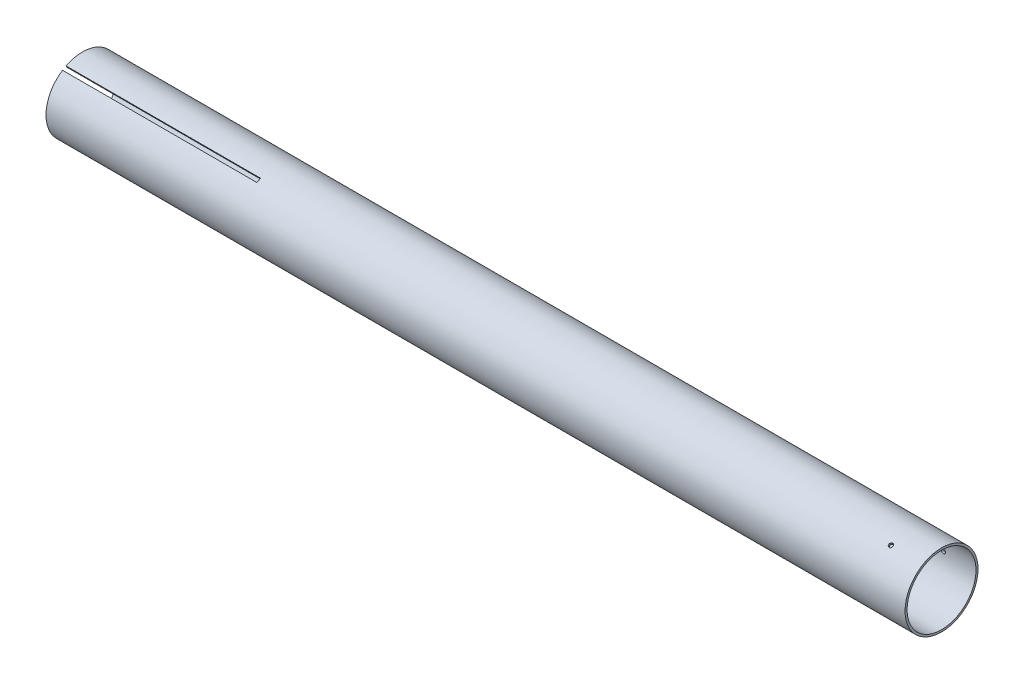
ISO-10303-21;
HEADER;
FILE_DESCRIPTION(('STEP AP214'),'2;1');
FILE_NAME('part.step','',(''),(''),'','','');
FILE_SCHEMA(('AUTOMOTIVE_DESIGN { 1 0 10303 214 1 1 1 1 }'));
ENDSEC;
DATA;
#1=APPLICATION_CONTEXT('core data for automotive mechanical design processes');
#2=APPLICATION_PROTOCOL_DEFINITION('international standard','automotive_design',2000,#1);
#3=PRODUCT_CONTEXT('',#1,'mechanical');
#4=PRODUCT('Part','Part','',(#3));
#5=PRODUCT_RELATED_PRODUCT_CATEGORY('part','',(#4));
#6=PRODUCT_DEFINITION_FORMATION('','',#4);
#7=PRODUCT_DEFINITION_CONTEXT('part definition',#1,'design');
#8=PRODUCT_DEFINITION('design','',#6,#7);
#9=PRODUCT_DEFINITION_SHAPE('','',#8);
#10=(LENGTH_UNIT() NAMED_UNIT(*) SI_UNIT(.MILLI.,.METRE.));
#11=(NAMED_UNIT(*) PLANE_ANGLE_UNIT() SI_UNIT($,.RADIAN.));
#12=(NAMED_UNIT(*) SI_UNIT($,.STERADIAN.) SOLID_ANGLE_UNIT());
#13=UNCERTAINTY_MEASURE_WITH_UNIT(LENGTH_MEASURE(1.E-05),#10,'distance_accuracy_value','');
#14=(GEOMETRIC_REPRESENTATION_CONTEXT(3) GLOBAL_UNCERTAINTY_ASSIGNED_CONTEXT((#13)) GLOBAL_UNIT_ASSIGNED_CONTEXT((#10,
#11,#12)) REPRESENTATION_CONTEXT('',''));
#15=CARTESIAN_POINT('',(0.,0.,0.));
#16=DIRECTION('',(0.,0.,1.));
#17=DIRECTION('',(1.,0.,0.));
#18=AXIS2_PLACEMENT_3D('',#15,#16,#17);
#19=CARTESIAN_POINT('',(0.,0.,0.));
#20=DIRECTION('',(1.,0.,0.));
#21=DIRECTION('',(0.,0.,-1.));
#22=AXIS2_PLACEMENT_3D('',#19,#20,#21);
#23=PLANE('',#22);
#24=CARTESIAN_POINT('',(0.,0.,0.));
#25=DIRECTION('',(1.,0.,0.));
#26=DIRECTION('',(0.,0.,-1.));
#27=AXIS2_PLACEMENT_3D('',#24,#25,#26);
#28=CIRCLE('',#27,28.575);
#29=CARTESIAN_POINT('',(0.,-25.5022070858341,12.8906190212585));
#30=VERTEX_POINT('',#29);
#31=CARTESIAN_POINT('',(0.,-1.5875,-28.5308686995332));
#32=VERTEX_POINT('',#31);
#33=EDGE_CURVE('E142',#30,#32,#28,.T.);
#34=ORIENTED_EDGE('',*,*,#33,.F.);
#35=DIRECTION('',(0.,0.866025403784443,-0.499999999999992));
#36=VECTOR('',#35,1.);
#37=CARTESIAN_POINT('',(0.,-34.5983379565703,18.142272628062));
#38=LINE('',#37,#36);
#39=CARTESIAN_POINT('',(0.,-24.1251398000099,12.0955688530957));
#40=VERTEX_POINT('',#39);
#41=EDGE_CURVE('E127',#30,#40,#38,.T.);
#42=ORIENTED_EDGE('',*,*,#41,.T.);
#43=CARTESIAN_POINT('',(0.,0.,0.));
#44=DIRECTION('',(1.,0.,0.));
#45=DIRECTION('',(0.,0.,-1.));
#46=AXIS2_PLACEMENT_3D('',#43,#44,#45);
#47=CIRCLE('',#46,26.9875);
#48=CARTESIAN_POINT('',(0.,-1.58749999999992,-26.9407683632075));
#49=VERTEX_POINT('',#48);
#50=EDGE_CURVE('E183',#40,#49,#47,.T.);
#51=ORIENTED_EDGE('',*,*,#50,.T.);
#52=DIRECTION('',(0.,0.,1.));
#53=VECTOR('',#52,1.);
#54=CARTESIAN_POINT('',(0.,-1.5875,-28.575));
#55=LINE('',#54,#53);
#56=EDGE_CURVE('E199',#32,#49,#55,.T.);
#57=ORIENTED_EDGE('',*,*,#56,.F.);
#58=EDGE_LOOP('',(#34,#42,#51,#57));
#59=FACE_BOUND('',#58,.T.);
#60=ADVANCED_FACE('F31',(#59),#23,.F.);
#61=CARTESIAN_POINT('',(0.,22.5376398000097,14.8451995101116));
#62=VERTEX_POINT('',#61);
#63=CARTESIAN_POINT('',(0.,-22.5376398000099,14.8451995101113));
#64=VERTEX_POINT('',#63);
#65=EDGE_CURVE('E136',#62,#64,#47,.T.);
#66=ORIENTED_EDGE('',*,*,#65,.T.);
#67=DIRECTION('',(0.,0.866025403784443,-0.499999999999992));
#68=VECTOR('',#67,1.);
#69=CARTESIAN_POINT('',(0.,-33.0108379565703,20.8919032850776));
#70=LINE('',#69,#68);
#71=CARTESIAN_POINT('',(0.,-23.9147070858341,15.6402496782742));
#72=VERTEX_POINT('',#71);
#73=EDGE_CURVE('E47',#72,#64,#70,.T.);
#74=ORIENTED_EDGE('',*,*,#73,.F.);
#75=CARTESIAN_POINT('',(0.,23.9147070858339,15.6402496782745));
#76=VERTEX_POINT('',#75);
#77=EDGE_CURVE('E134',#76,#72,#28,.T.);
#78=ORIENTED_EDGE('',*,*,#77,.F.);
#79=DIRECTION('',(0.,-0.866025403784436,-0.500000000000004));
#80=VECTOR('',#79,1.);
#81=CARTESIAN_POINT('',(0.,33.0108379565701,20.8919032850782));
#82=LINE('',#81,#80);
#83=EDGE_CURVE('E247',#76,#62,#82,.T.);
#84=ORIENTED_EDGE('',*,*,#83,.T.);
#85=EDGE_LOOP('',(#66,#74,#78,#84));
#86=FACE_BOUND('',#85,.T.);
#87=ADVANCED_FACE('F132',(#86),#23,.F.);
#88=CARTESIAN_POINT('',(673.1,0.,0.));
#89=DIRECTION('',(1.,0.,0.));
#90=DIRECTION('',(0.,0.,-1.));
#91=AXIS2_PLACEMENT_3D('',#88,#89,#90);
#92=PLANE('',#91);
#93=CARTESIAN_POINT('',(673.1,0.,0.));
#94=DIRECTION('',(1.,0.,0.));
#95=DIRECTION('',(0.,0.,-1.));
#96=AXIS2_PLACEMENT_3D('',#93,#94,#95);
#97=CIRCLE('',#96,28.575);
#98=CARTESIAN_POINT('',(673.1,0.,-28.575));
#99=VERTEX_POINT('',#98);
#100=EDGE_CURVE('E145',#99,#99,#97,.T.);
#101=ORIENTED_EDGE('',*,*,#100,.T.);
#102=EDGE_LOOP('',(#101));
#103=FACE_BOUND('',#102,.T.);
#104=CARTESIAN_POINT('',(673.1,0.,0.));
#105=DIRECTION('',(1.,0.,0.));
#106=DIRECTION('',(0.,0.,-1.));
#107=AXIS2_PLACEMENT_3D('',#104,#105,#106);
#108=CIRCLE('',#107,26.9875);
#109=CARTESIAN_POINT('',(673.1,0.,-26.9875));
#110=VERTEX_POINT('',#109);
#111=EDGE_CURVE('E146',#110,#110,#108,.T.);
#112=ORIENTED_EDGE('',*,*,#111,.F.);
#113=EDGE_LOOP('',(#112));
#114=FACE_BOUND('',#113,.T.);
#115=ADVANCED_FACE('F316',(#103,#114),#92,.T.);
#116=CARTESIAN_POINT('',(0.,1.58750000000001,-26.9407683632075));
#117=VERTEX_POINT('',#116);
#118=CARTESIAN_POINT('',(0.,24.1251398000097,12.0955688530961));
#119=VERTEX_POINT('',#118);
#120=EDGE_CURVE('E187',#117,#119,#47,.T.);
#121=ORIENTED_EDGE('',*,*,#120,.T.);
#122=DIRECTION('',(0.,-0.866025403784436,-0.500000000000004));
#123=VECTOR('',#122,1.);
#124=CARTESIAN_POINT('',(0.,34.5983379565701,18.1422726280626));
#125=LINE('',#124,#123);
#126=CARTESIAN_POINT('',(0.,25.5022070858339,12.8906190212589));
#127=VERTEX_POINT('',#126);
#128=EDGE_CURVE('E55',#127,#119,#125,.T.);
#129=ORIENTED_EDGE('',*,*,#128,.F.);
#130=CARTESIAN_POINT('',(0.,1.58750000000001,-28.5308686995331));
#131=VERTEX_POINT('',#130);
#132=EDGE_CURVE('E141',#131,#127,#28,.T.);
#133=ORIENTED_EDGE('',*,*,#132,.F.);
#134=DIRECTION('',(0.,0.,1.));
#135=VECTOR('',#134,1.);
#136=CARTESIAN_POINT('',(0.,1.58750000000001,-28.575));
#137=LINE('',#136,#135);
#138=EDGE_CURVE('E262',#131,#117,#137,.T.);
#139=ORIENTED_EDGE('',*,*,#138,.T.);
#140=EDGE_LOOP('',(#121,#129,#133,#139));
#141=FACE_BOUND('',#140,.T.);
#142=ADVANCED_FACE('F312',(#141),#23,.F.);
#143=CARTESIAN_POINT('',(673.1,0.,0.));
#144=DIRECTION('',(-1.,0.,0.));
#145=DIRECTION('',(0.,0.,1.));
#146=AXIS2_PLACEMENT_3D('',#143,#144,#145);
#147=CYLINDRICAL_SURFACE('',#146,28.575);
#148=CARTESIAN_POINT('',(647.7,-23.9147070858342,15.6402496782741));
#149=CARTESIAN_POINT('',(647.789096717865,-23.9147095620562,15.6402465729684));
#150=CARTESIAN_POINT('',(647.878256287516,-23.9188353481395,15.6339429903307));
#151=CARTESIAN_POINT('',(648.054114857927,-23.9352050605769,15.6088692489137));
#152=CARTESIAN_POINT('',(648.140810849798,-23.9474585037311,15.5900844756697));
#153=CARTESIAN_POINT('',(648.309169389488,-23.9796415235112,15.5405368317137));
#154=CARTESIAN_POINT('',(648.390834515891,-23.9995671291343,15.5097801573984));
#155=CARTESIAN_POINT('',(648.546840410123,-24.0463856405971,15.4370924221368));
#156=CARTESIAN_POINT('',(648.621182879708,-24.0732769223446,15.3951639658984));
#157=CARTESIAN_POINT('',(648.760545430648,-24.1331300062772,15.3011685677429));
#158=CARTESIAN_POINT('',(648.825555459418,-24.1660982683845,15.249090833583));
#159=CARTESIAN_POINT('',(648.944321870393,-24.2369716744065,15.1361904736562));
#160=CARTESIAN_POINT('',(648.998077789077,-24.2748770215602,15.0753674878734));
#161=CARTESIAN_POINT('',(649.092839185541,-24.3544009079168,14.9465549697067));
#162=CARTESIAN_POINT('',(649.133836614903,-24.3960217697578,14.8785609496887));
#163=CARTESIAN_POINT('',(649.201865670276,-24.4816262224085,14.7372798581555));
#164=CARTESIAN_POINT('',(649.22889742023,-24.5256097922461,14.6639928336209));
#165=CARTESIAN_POINT('',(649.268200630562,-24.6145370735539,14.5142262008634));
#166=CARTESIAN_POINT('',(649.280487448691,-24.6594797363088,14.4377500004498));
#167=CARTESIAN_POINT('',(649.289999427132,-24.749041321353,14.2836800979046));
#168=CARTESIAN_POINT('',(649.287224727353,-24.7936602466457,14.2060864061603));
#169=CARTESIAN_POINT('',(649.266705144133,-24.8812677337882,14.0520810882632));
#170=CARTESIAN_POINT('',(649.248976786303,-24.9242580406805,13.97566825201));
#171=CARTESIAN_POINT('',(649.199078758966,-25.0075126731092,13.826144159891));
#172=CARTESIAN_POINT('',(649.166909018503,-25.0477769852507,13.7530329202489));
#173=CARTESIAN_POINT('',(649.089022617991,-25.1245848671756,13.6122115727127));
#174=CARTESIAN_POINT('',(649.043298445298,-25.1611263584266,13.5445044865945));
#175=CARTESIAN_POINT('',(648.939606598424,-25.2295923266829,13.416540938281));
#176=CARTESIAN_POINT('',(648.881638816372,-25.261516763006,13.3562845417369));
#177=CARTESIAN_POINT('',(648.75501185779,-25.3200680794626,13.2449517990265));
#178=CARTESIAN_POINT('',(648.686338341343,-25.3466877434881,13.1938879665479));
#179=CARTESIAN_POINT('',(648.540299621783,-25.3940021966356,13.1025924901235));
#180=CARTESIAN_POINT('',(648.462934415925,-25.4146969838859,13.0623608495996));
#181=CARTESIAN_POINT('',(648.301699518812,-25.4497341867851,12.9939654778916));
#182=CARTESIAN_POINT('',(648.217829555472,-25.4640763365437,12.9658022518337));
#183=CARTESIAN_POINT('',(648.045969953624,-25.4861183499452,12.922422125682));
#184=CARTESIAN_POINT('',(647.957980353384,-25.493818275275,12.9072051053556));
#185=CARTESIAN_POINT('',(647.7805050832,-25.5024180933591,12.8902051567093));
#186=CARTESIAN_POINT('',(647.69102156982,-25.503327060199,12.8884043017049));
#187=CARTESIAN_POINT('',(647.512987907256,-25.4983511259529,12.8982457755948));
#188=CARTESIAN_POINT('',(647.424437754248,-25.4924662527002,12.9098880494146));
#189=CARTESIAN_POINT('',(647.25084093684,-25.4740242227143,12.9462398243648));
#190=CARTESIAN_POINT('',(647.165792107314,-25.4614712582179,12.9709411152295));
#191=CARTESIAN_POINT('',(647.00154540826,-25.4299456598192,13.0326391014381));
#192=CARTESIAN_POINT('',(646.922347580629,-25.4109729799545,13.0696358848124));
#193=CARTESIAN_POINT('',(646.771958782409,-25.3669721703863,13.15483334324));
#194=CARTESIAN_POINT('',(646.700776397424,-25.3419376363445,13.2030458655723));
#195=CARTESIAN_POINT('',(646.568525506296,-25.2863553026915,13.3091862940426));
#196=CARTESIAN_POINT('',(646.50745707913,-25.2558074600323,13.3671142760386));
#197=CARTESIAN_POINT('',(646.397100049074,-25.1898421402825,13.4910118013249));
#198=CARTESIAN_POINT('',(646.347824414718,-25.1544193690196,13.5569900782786));
#199=CARTESIAN_POINT('',(646.262540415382,-25.0795639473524,13.6949716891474));
#200=CARTESIAN_POINT('',(646.226531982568,-25.0401313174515,13.766974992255));
#201=CARTESIAN_POINT('',(646.168827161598,-24.9582634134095,13.9148425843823));
#202=CARTESIAN_POINT('',(646.147122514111,-24.9158298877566,13.9907046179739));
#203=CARTESIAN_POINT('',(646.118614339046,-24.8290599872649,14.1441213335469));
#204=CARTESIAN_POINT('',(646.11181070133,-24.7847236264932,14.2216760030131));
#205=CARTESIAN_POINT('',(646.113298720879,-24.695443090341,14.3761491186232));
#206=CARTESIAN_POINT('',(646.121570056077,-24.6504998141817,14.4530682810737));
#207=CARTESIAN_POINT('',(646.152931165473,-24.5612567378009,14.6042116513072));
#208=CARTESIAN_POINT('',(646.176020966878,-24.5169569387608,14.6784358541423));
#209=CARTESIAN_POINT('',(646.23635921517,-24.4303476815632,14.822138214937));
#210=CARTESIAN_POINT('',(646.273607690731,-24.3880382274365,14.8916163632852));
#211=CARTESIAN_POINT('',(646.361202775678,-24.3067451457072,15.0239409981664));
#212=CARTESIAN_POINT('',(646.41154900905,-24.2677614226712,15.0867876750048));
#213=CARTESIAN_POINT('',(646.523984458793,-24.1943423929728,15.2042505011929));
#214=CARTESIAN_POINT('',(646.586088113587,-24.1599127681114,15.2588563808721));
#215=CARTESIAN_POINT('',(646.720260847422,-24.096807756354,15.3583189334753));
#216=CARTESIAN_POINT('',(646.79233236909,-24.0681337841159,15.4031732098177));
#217=CARTESIAN_POINT('',(646.944462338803,-24.0175127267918,15.4819866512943));
#218=CARTESIAN_POINT('',(647.024529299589,-23.9955729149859,15.5159340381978));
#219=CARTESIAN_POINT('',(647.19025667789,-23.9592564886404,15.5719548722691));
#220=CARTESIAN_POINT('',(647.275910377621,-23.9448709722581,15.594042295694));
#221=CARTESIAN_POINT('',(647.418410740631,-23.9279369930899,15.6200061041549));
#222=CARTESIAN_POINT('',(647.474335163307,-23.9229835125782,15.6275884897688));
#223=CARTESIAN_POINT('',(647.586831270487,-23.9163677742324,15.637711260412));
#224=CARTESIAN_POINT('',(647.643402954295,-23.9147055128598,15.6402516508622));
#225=CARTESIAN_POINT('',(647.7,-23.9147070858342,15.6402496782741));
#226=B_SPLINE_CURVE_WITH_KNOTS('',3,(#148,#149,#150,#151,#152,#153,#154,#155,#156,#157,#158,
#159,#160,#161,#162,#163,#164,#165,#166,#167,#168,#169,#170,#171,#172,#173,#174,#175,#176,#177,
#178,#179,#180,#181,#182,#183,#184,#185,#186,#187,#188,#189,#190,#191,#192,#193,#194,#195,#196,
#197,#198,#199,#200,#201,#202,#203,#204,#205,#206,#207,#208,#209,#210,#211,#212,#213,#214,#215,
#216,#217,#218,#219,#220,#221,#222,#223,#224,#225),.UNSPECIFIED.,.T.,.F.,(4,2,2,2,2,2,2,2,2,2,2,
2,2,2,2,2,2,2,2,2,2,2,2,2,2,2,2,2,2,2,2,2,2,2,2,2,2,2,4),(0.,0.267083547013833,
0.534480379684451,0.801738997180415,1.06893535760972,1.33641740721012,1.60391047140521,
1.87157193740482,2.13923102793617,2.40661109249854,2.67398867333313,2.94107115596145,
3.20815495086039,3.47538705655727,3.74262151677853,4.01021705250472,4.27781267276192,
4.54541949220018,4.81302382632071,5.0802705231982,5.34751612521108,5.61459390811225,
5.88167360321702,6.14903670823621,6.41640190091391,6.68405977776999,6.95171628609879,
7.21921810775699,7.4867179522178,7.75385745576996,8.02099744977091,8.28813798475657,
8.55527085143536,8.82273391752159,9.09026264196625,9.3580793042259,9.62557966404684,
9.79523974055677,9.96489963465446),.UNSPECIFIED.);
#227=CARTESIAN_POINT('',(647.7,-23.9147070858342,15.6402496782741));
#228=VERTEX_POINT('',#227);
#229=EDGE_CURVE('E273',#228,#228,#226,.T.);
#230=ORIENTED_EDGE('',*,*,#229,.T.);
#231=EDGE_LOOP('',(#230));
#232=FACE_BOUND('',#231,.T.);
#233=CARTESIAN_POINT('',(647.7,25.5022070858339,12.890619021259));
#234=CARTESIAN_POINT('',(647.789096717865,25.5022056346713,12.890622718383));
#235=CARTESIAN_POINT('',(647.878256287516,25.4988094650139,12.8973475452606));
#236=CARTESIAN_POINT('',(648.054114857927,25.4852798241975,12.9240610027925));
#237=CARTESIAN_POINT('',(648.140810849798,25.475138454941,12.9440651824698));
#238=CARTESIAN_POINT('',(648.309169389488,25.4483204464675,12.9967103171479));
#239=CARTESIAN_POINT('',(648.390834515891,25.431647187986,13.029344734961));
#240=CARTESIAN_POINT('',(648.546840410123,25.3921070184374,13.1062346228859));
#241=CARTESIAN_POINT('',(648.621182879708,25.3692415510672,13.1504873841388));
#242=CARTESIAN_POINT('',(648.760545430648,25.317765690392,13.249319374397));
#243=CARTESIAN_POINT('',(648.825555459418,25.2891491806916,13.3039095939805));
#244=CARTESIAN_POINT('',(648.944321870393,25.2268113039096,13.4217379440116));
#245=CARTESIAN_POINT('',(648.998077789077,25.1930897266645,13.4849764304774));
#246=CARTESIAN_POINT('',(649.092839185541,25.1212967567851,13.6182523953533));
#247=CARTESIAN_POINT('',(649.133836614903,25.0832226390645,13.688294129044));
#248=CARTESIAN_POINT('',(649.201865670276,25.0036718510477,13.8330703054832));
#249=CARTESIAN_POINT('',(649.22889742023,24.9621952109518,13.9078047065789));
#250=CARTESIAN_POINT('',(649.268200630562,24.8769571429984,14.0597013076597));
#251=CARTESIAN_POINT('',(649.280487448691,24.8331981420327,14.136860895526));
#252=CARTESIAN_POINT('',(649.289999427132,24.7445504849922,14.29145845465));
#253=CARTESIAN_POINT('',(649.287224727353,24.6996618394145,14.3688964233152));
#254=CARTESIAN_POINT('',(649.266705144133,24.610093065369,14.5217693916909));
#255=CARTESIAN_POINT('',(649.248976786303,24.5654127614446,14.5972065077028));
#256=CARTESIAN_POINT('',(649.199078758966,24.4775484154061,14.7440691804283));
#257=CARTESIAN_POINT('',(649.166909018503,24.4343643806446,14.8154947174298));
#258=CARTESIAN_POINT('',(649.089022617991,24.3508134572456,14.9524229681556));
#259=CARTESIAN_POINT('',(649.043298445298,24.3104481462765,15.0179223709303));
#260=CARTESIAN_POINT('',(648.939606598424,24.2338614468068,15.1411974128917));
#261=CARTESIAN_POINT('',(648.881638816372,24.1976400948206,15.198972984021));
#262=CARTESIAN_POINT('',(648.75501185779,24.1304987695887,15.3053462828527));
#263=CARTESIAN_POINT('',(648.686338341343,24.0995860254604,15.3539315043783));
#264=CARTESIAN_POINT('',(648.540299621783,24.0441790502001,15.4405547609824));
#265=CARTESIAN_POINT('',(648.462934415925,24.0196848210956,15.4785927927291));
#266=CARTESIAN_POINT('',(648.301699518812,23.9779712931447,15.5431335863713));
#267=CARTESIAN_POINT('',(648.217829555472,23.9607522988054,15.5696358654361));
#268=CARTESIAN_POINT('',(648.045969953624,23.9342050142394,15.6104148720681));
#269=CARTESIAN_POINT('',(647.957980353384,23.9248766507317,15.6246917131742));
#270=CARTESIAN_POINT('',(647.7805050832,23.914454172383,15.6406393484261));
#271=CARTESIAN_POINT('',(647.69102156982,23.9133490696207,15.6423269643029));
#272=CARTESIAN_POINT('',(647.512987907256,23.9193840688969,15.6330969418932));
#273=CARTESIAN_POINT('',(647.424437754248,23.9265241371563,15.6221793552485));
#274=CARTESIAN_POINT('',(647.25084093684,23.9487846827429,15.5880322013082));
#275=CARTESIAN_POINT('',(647.165792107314,23.9639001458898,15.5648103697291));
#276=CARTESIAN_POINT('',(647.00154540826,24.0015693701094,15.5066594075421));
#277=CARTESIAN_POINT('',(646.922347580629,24.0241231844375,15.4717301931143));
#278=CARTESIAN_POINT('',(646.771958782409,24.0759059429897,15.3910256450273));
#279=CARTESIAN_POINT('',(646.700776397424,24.105141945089,15.3452388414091));
#280=CARTESIAN_POINT('',(646.568525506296,24.1692710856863,15.2440329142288));
#281=CARTESIAN_POINT('',(646.50745707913,24.2041642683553,15.1886137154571));
#282=CARTESIAN_POINT('',(646.397100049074,24.2784800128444,15.0695373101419));
#283=CARTESIAN_POINT('',(646.347824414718,24.3179074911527,15.0058711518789));
#284=CARTESIAN_POINT('',(646.262540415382,24.3999753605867,14.8720536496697));
#285=CARTESIAN_POINT('',(646.226531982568,24.4426157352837,14.8019023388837));
#286=CARTESIAN_POINT('',(646.168827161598,24.5297388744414,14.6570688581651));
#287=CARTESIAN_POINT('',(646.147122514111,24.574220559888,14.5823893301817));
#288=CARTESIAN_POINT('',(646.118614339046,24.6636983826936,14.4305360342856));
#289=CARTESIAN_POINT('',(646.11181070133,24.7086945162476,14.3533622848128));
#290=CARTESIAN_POINT('',(646.113298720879,24.7978318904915,14.1988065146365));
#291=CARTESIAN_POINT('',(646.121570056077,24.8419742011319,14.121424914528));
#292=CARTESIAN_POINT('',(646.152931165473,24.9282466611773,13.9685664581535));
#293=CARTESIAN_POINT('',(646.176020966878,24.970376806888,13.8930896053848));
#294=CARTESIAN_POINT('',(646.23635921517,25.0515220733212,13.7462326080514));
#295=CARTESIAN_POINT('',(646.273607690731,25.0905371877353,13.6748524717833));
#296=CARTESIAN_POINT('',(646.361202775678,25.1644871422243,13.5382882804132));
#297=CARTESIAN_POINT('',(646.41154900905,25.1994220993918,13.4731040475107));
#298=CARTESIAN_POINT('',(646.523984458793,25.2644383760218,13.3507898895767));
#299=CARTESIAN_POINT('',(646.586088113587,25.2945136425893,13.2936700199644));
#300=CARTESIAN_POINT('',(646.720260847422,25.3490982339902,13.1892882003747));
#301=CARTESIAN_POINT('',(646.79233236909,25.373606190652,13.1420286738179));
#302=CARTESIAN_POINT('',(646.944462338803,25.4165501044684,13.0587828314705));
#303=CARTESIAN_POINT('',(647.024529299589,25.434979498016,13.0228087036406));
#304=CARTESIAN_POINT('',(647.19025667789,25.4653367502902,12.9633473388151));
#305=CARTESIAN_POINT('',(647.275910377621,25.4772722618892,12.939845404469));
#306=CARTESIAN_POINT('',(647.418410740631,25.4912905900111,12.9121982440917));
#307=CARTESIAN_POINT('',(647.474335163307,25.4953803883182,12.9041172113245));
#308=CARTESIAN_POINT('',(647.586831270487,25.500839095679,12.8933264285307));
#309=CARTESIAN_POINT('',(647.643402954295,25.5022080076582,12.8906166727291));
#310=CARTESIAN_POINT('',(647.7,25.5022070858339,12.890619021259));
#311=B_SPLINE_CURVE_WITH_KNOTS('',3,(#233,#234,#235,#236,#237,#238,#239,#240,#241,#242,#243,
#244,#245,#246,#247,#248,#249,#250,#251,#252,#253,#254,#255,#256,#257,#258,#259,#260,#261,#262,
#263,#264,#265,#266,#267,#268,#269,#270,#271,#272,#273,#274,#275,#276,#277,#278,#279,#280,#281,
#282,#283,#284,#285,#286,#287,#288,#289,#290,#291,#292,#293,#294,#295,#296,#297,#298,#299,#300,
#301,#302,#303,#304,#305,#306,#307,#308,#309,#310),.UNSPECIFIED.,.T.,.F.,(4,2,2,2,2,2,2,2,2,2,2,
2,2,2,2,2,2,2,2,2,2,2,2,2,2,2,2,2,2,2,2,2,2,2,2,2,2,2,4),(0.,0.267083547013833,
0.534480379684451,0.801738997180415,1.06893535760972,1.33641740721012,1.60391047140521,
1.87157193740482,2.13923102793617,2.40661109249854,2.67398867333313,2.94107115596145,
3.20815495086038,3.47538705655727,3.74262151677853,4.01021705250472,4.27781267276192,
4.54541949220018,4.81302382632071,5.0802705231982,5.34751612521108,5.61459390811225,
5.88167360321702,6.1490367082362,6.41640190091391,6.68405977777,6.95171628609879,
7.21921810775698,7.4867179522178,7.75385745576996,8.0209974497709,8.28813798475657,
8.55527085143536,8.82273391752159,9.09026264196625,9.35807930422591,9.62557966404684,
9.79523974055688,9.96489963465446),.UNSPECIFIED.);
#312=CARTESIAN_POINT('',(647.7,25.5022070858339,12.890619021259));
#313=VERTEX_POINT('',#312);
#314=EDGE_CURVE('E161',#313,#313,#311,.T.);
#315=ORIENTED_EDGE('',*,*,#314,.T.);
#316=EDGE_LOOP('',(#315));
#317=FACE_BOUND('',#316,.T.);
#318=CARTESIAN_POINT('',(649.2875,0.,-28.575));
#319=CARTESIAN_POINT('',(649.287496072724,0.0890968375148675,-28.5749994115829));
#320=CARTESIAN_POINT('',(649.279974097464,0.178256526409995,-28.5745788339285));
#321=CARTESIAN_POINT('',(649.250074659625,0.354115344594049,-28.5729414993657));
#322=CARTESIAN_POINT('',(649.227679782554,0.440811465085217,-28.5717238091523));
#323=CARTESIAN_POINT('',(649.168678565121,0.609170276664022,-28.5686300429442));
#324=CARTESIAN_POINT('',(649.132079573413,0.690835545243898,-28.5667543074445));
#325=CARTESIAN_POINT('',(649.045720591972,0.846841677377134,-28.5625555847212));
#326=CARTESIAN_POINT('',(648.995963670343,0.921184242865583,-28.5602327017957));
#327=CARTESIAN_POINT('',(648.884634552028,1.0605466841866,-28.5553977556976));
#328=CARTESIAN_POINT('',(648.823049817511,1.12555653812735,-28.5528854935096));
#329=CARTESIAN_POINT('',(648.689838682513,1.24432261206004,-28.5479566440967));
#330=CARTESIAN_POINT('',(648.618211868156,1.29807836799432,-28.5455400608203));
#331=CARTESIAN_POINT('',(648.466895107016,1.39283959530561,-28.5410736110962));
#332=CARTESIAN_POINT('',(648.387200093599,1.43383698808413,-28.5390239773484));
#333=CARTESIAN_POINT('',(648.222044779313,1.50186596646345,-28.535525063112));
#334=CARTESIAN_POINT('',(648.136584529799,1.52889767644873,-28.5340757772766));
#335=CARTESIAN_POINT('',(647.962419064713,1.56820080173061,-28.5319428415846));
#336=CARTESIAN_POINT('',(647.873717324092,1.58048757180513,-28.5312583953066));
#337=CARTESIAN_POINT('',(647.695507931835,1.58999942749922,-28.5307299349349));
#338=CARTESIAN_POINT('',(647.606000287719,1.58722465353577,-28.5308859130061));
#339=CARTESIAN_POINT('',(647.428824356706,1.56670495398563,-28.5320199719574));
#340=CARTESIAN_POINT('',(647.3411541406,1.54897662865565,-28.5329971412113));
#341=CARTESIAN_POINT('',(647.170035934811,1.49907880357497,-28.5356620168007));
#342=CARTESIAN_POINT('',(647.086587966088,1.46690923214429,-28.5373497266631));
#343=CARTESIAN_POINT('',(646.926229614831,1.38902317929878,-28.5412465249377));
#344=CARTESIAN_POINT('',(646.849322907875,1.34329914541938,-28.5434559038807));
#345=CARTESIAN_POINT('',(646.704270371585,1.23960759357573,-28.5481467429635));
#346=CARTESIAN_POINT('',(646.636124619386,1.18163996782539,-28.5506282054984));
#347=CARTESIAN_POINT('',(646.510431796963,1.05501311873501,-28.5555875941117));
#348=CARTESIAN_POINT('',(646.452899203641,0.986339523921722,-28.5580655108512));
#349=CARTESIAN_POINT('',(646.350177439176,0.840300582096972,-28.5627353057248));
#350=CARTESIAN_POINT('',(646.304988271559,0.762935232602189,-28.5649271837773));
#351=CARTESIAN_POINT('',(646.228237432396,0.601700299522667,-28.5687780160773));
#352=CARTESIAN_POINT('',(646.196676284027,0.517830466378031,-28.5704369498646));
#353=CARTESIAN_POINT('',(646.148086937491,0.345971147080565,-28.5730346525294));
#354=CARTESIAN_POINT('',(646.131058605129,0.257981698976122,-28.5739734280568));
#355=CARTESIAN_POINT('',(646.112036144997,0.080506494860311,-28.5750241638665));
#356=CARTESIAN_POINT('',(646.110021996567,-0.00897710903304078,-28.575137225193));
#357=CARTESIAN_POINT('',(646.121032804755,-0.187010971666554,-28.5745267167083));
#358=CARTESIAN_POINT('',(646.134057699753,-0.275561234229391,-28.573803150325));
#359=CARTESIAN_POINT('',(646.174760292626,-0.449158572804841,-28.5716015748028));
#360=CARTESIAN_POINT('',(646.202428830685,-0.534207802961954,-28.5701240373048));
#361=CARTESIAN_POINT('',(646.271624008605,-0.698455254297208,-28.5665808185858));
#362=CARTESIAN_POINT('',(646.313150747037,-0.777653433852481,-28.5645151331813));
#363=CARTESIAN_POINT('',(646.408934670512,-0.92804246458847,-28.5600251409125));
#364=CARTESIAN_POINT('',(646.46320525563,-0.999224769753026,-28.5576004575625));
#365=CARTESIAN_POINT('',(646.582916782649,-1.13147547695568,-28.5526667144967));
#366=CARTESIAN_POINT('',(646.648357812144,-1.19254379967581,-28.5501576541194));
#367=CARTESIAN_POINT('',(646.788638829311,-1.30290061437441,-28.5453347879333));
#368=CARTESIAN_POINT('',(646.863489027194,-1.3521761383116,-28.5430211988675));
#369=CARTESIAN_POINT('',(647.020412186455,-1.43745994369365,-28.5388535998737));
#370=CARTESIAN_POINT('',(647.102485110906,-1.47346829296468,-28.5369995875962));
#371=CARTESIAN_POINT('',(647.271476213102,-1.53117305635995,-28.5339617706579));
#372=CARTESIAN_POINT('',(647.358391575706,-1.55287769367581,-28.5327775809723));
#373=CARTESIAN_POINT('',(647.534639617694,-1.58138579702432,-28.5312118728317));
#374=CARTESIAN_POINT('',(647.623972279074,-1.58818937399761,-28.5308303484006));
#375=CARTESIAN_POINT('',(647.802390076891,-1.58670118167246,-28.5309131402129));
#376=CARTESIAN_POINT('',(647.891475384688,-1.57842980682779,-28.5313763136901));
#377=CARTESIAN_POINT('',(648.066990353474,-1.54706871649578,-28.5330938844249));
#378=CARTESIAN_POINT('',(648.153420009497,-1.52397897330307,-28.5343482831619));
#379=CARTESIAN_POINT('',(648.321173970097,-1.46364094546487,-28.5375066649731));
#380=CARTESIAN_POINT('',(648.402498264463,-1.42639263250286,-28.5394106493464));
#381=CARTESIAN_POINT('',(648.557740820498,-1.33879795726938,-28.5436535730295));
#382=CARTESIAN_POINT('',(648.631659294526,-1.28845197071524,-28.5459924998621));
#383=CARTESIAN_POINT('',(648.770094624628,-1.17601678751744,-28.5508453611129));
#384=CARTESIAN_POINT('',(648.834599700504,-1.11391309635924,-28.5533595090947));
#385=CARTESIAN_POINT('',(648.952289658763,-0.979740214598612,-28.5582777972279));
#386=CARTESIAN_POINT('',(649.005471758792,-0.907668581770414,-28.560681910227));
#387=CARTESIAN_POINT('',(649.099036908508,-0.755538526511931,-28.5651112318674));
#388=CARTESIAN_POINT('',(649.139406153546,-0.675471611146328,-28.5671360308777));
#389=CARTESIAN_POINT('',(649.206079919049,-0.509744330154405,-28.5705727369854));
#390=CARTESIAN_POINT('',(649.232400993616,-0.424090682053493,-28.5719853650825));
#391=CARTESIAN_POINT('',(649.263353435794,-0.281590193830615,-28.5736663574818));
#392=CARTESIAN_POINT('',(649.272396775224,-0.22566558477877,-28.5741642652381));
#393=CARTESIAN_POINT('',(649.284471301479,-0.113169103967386,-28.5748312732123));
#394=CARTESIAN_POINT('',(649.287502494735,-0.0565972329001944,-28.5750003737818));
#395=CARTESIAN_POINT('',(649.2875,0.,-28.575));
#396=B_SPLINE_CURVE_WITH_KNOTS('',3,(#318,#319,#320,#321,#322,#323,#324,#325,#326,#327,#328,
#329,#330,#331,#332,#333,#334,#335,#336,#337,#338,#339,#340,#341,#342,#343,#344,#345,#346,#347,
#348,#349,#350,#351,#352,#353,#354,#355,#356,#357,#358,#359,#360,#361,#362,#363,#364,#365,#366,
#367,#368,#369,#370,#371,#372,#373,#374,#375,#376,#377,#378,#379,#380,#381,#382,#383,#384,#385,
#386,#387,#388,#389,#390,#391,#392,#393,#394,#395),.UNSPECIFIED.,.T.,.F.,(4,2,2,2,2,2,2,2,2,2,2,
2,2,2,2,2,2,2,2,2,2,2,2,2,2,2,2,2,2,2,2,2,2,2,2,2,2,2,4),(0.,0.267083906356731,
0.534481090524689,0.801740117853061,1.06893688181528,1.33641846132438,1.60391106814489,
1.87157270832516,2.13923196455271,2.40661224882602,2.67399004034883,2.94107140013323,
3.20815408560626,3.47538586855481,3.7426200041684,4.01021600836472,4.27781208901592,
4.54541844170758,4.81302232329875,5.08026930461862,5.34751519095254,5.61459410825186,
5.88167492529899,6.14903784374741,6.41640285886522,6.68406054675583,6.95171686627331,
7.21921917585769,7.48671949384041,7.75385818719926,8.02099738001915,8.28813710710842,
8.55526917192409,8.8227327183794,9.09026191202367,9.35807837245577,9.62557854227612,
9.79523917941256,9.96489963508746),.UNSPECIFIED.);
#397=CARTESIAN_POINT('',(649.2875,0.,-28.575));
#398=VERTEX_POINT('',#397);
#399=EDGE_CURVE('E160',#398,#398,#396,.T.);
#400=ORIENTED_EDGE('',*,*,#399,.T.);
#401=EDGE_LOOP('',(#400));
#402=FACE_BOUND('',#401,.T.);
#403=ORIENTED_EDGE('',*,*,#100,.F.);
#404=EDGE_LOOP('',(#403));
#405=FACE_BOUND('',#404,.T.);
#406=CARTESIAN_POINT('',(152.4,0.,0.));
#407=DIRECTION('',(1.,0.,0.));
#408=DIRECTION('',(0.,1.,0.));
#409=AXIS2_PLACEMENT_3D('',#406,#407,#408);
#410=CIRCLE('',#409,28.575);
#411=CARTESIAN_POINT('',(152.4,-23.9147070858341,15.6402496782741));
#412=VERTEX_POINT('',#411);
#413=CARTESIAN_POINT('',(152.4,-25.5022070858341,12.8906190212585));
#414=VERTEX_POINT('',#413);
#415=EDGE_CURVE('E126',#412,#414,#410,.T.);
#416=ORIENTED_EDGE('',*,*,#415,.T.);
#417=DIRECTION('',(-1.,0.,0.));
#418=VECTOR('',#417,1.);
#419=CARTESIAN_POINT('',(673.1,-25.5022070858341,12.8906190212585));
#420=LINE('',#419,#418);
#421=EDGE_CURVE('E240',#414,#30,#420,.T.);
#422=ORIENTED_EDGE('',*,*,#421,.T.);
#423=ORIENTED_EDGE('',*,*,#33,.T.);
#424=DIRECTION('',(-1.,0.,0.));
#425=VECTOR('',#424,1.);
#426=CARTESIAN_POINT('',(673.1,-1.58749999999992,-28.5308686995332));
#427=LINE('',#426,#425);
#428=CARTESIAN_POINT('',(152.4,-1.58749999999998,-28.5308686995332));
#429=VERTEX_POINT('',#428);
#430=EDGE_CURVE('E209',#32,#429,#427,.F.);
#431=ORIENTED_EDGE('',*,*,#430,.T.);
#432=CARTESIAN_POINT('',(152.4,0.,0.));
#433=DIRECTION('',(1.,0.,0.));
#434=DIRECTION('',(0.,0.,-1.));
#435=AXIS2_PLACEMENT_3D('',#432,#433,#434);
#436=CIRCLE('',#435,28.575);
#437=CARTESIAN_POINT('',(152.4,1.58750000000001,-28.5308686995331));
#438=VERTEX_POINT('',#437);
#439=EDGE_CURVE('E269',#429,#438,#436,.T.);
#440=ORIENTED_EDGE('',*,*,#439,.T.);
#441=DIRECTION('',(-1.,0.,0.));
#442=VECTOR('',#441,1.);
#443=CARTESIAN_POINT('',(673.1,1.58750000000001,-28.5308686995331));
#444=LINE('',#443,#442);
#445=EDGE_CURVE('E271',#438,#131,#444,.T.);
#446=ORIENTED_EDGE('',*,*,#445,.T.);
#447=ORIENTED_EDGE('',*,*,#132,.T.);
#448=DIRECTION('',(-1.,0.,0.));
#449=VECTOR('',#448,1.);
#450=CARTESIAN_POINT('',(673.1,25.5022070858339,12.890619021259));
#451=LINE('',#450,#449);
#452=CARTESIAN_POINT('',(152.4,25.5022070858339,12.8906190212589));
#453=VERTEX_POINT('',#452);
#454=EDGE_CURVE('E249',#127,#453,#451,.F.);
#455=ORIENTED_EDGE('',*,*,#454,.T.);
#456=CARTESIAN_POINT('',(152.4,0.,0.));
#457=DIRECTION('',(1.,0.,0.));
#458=DIRECTION('',(0.,1.,0.));
#459=AXIS2_PLACEMENT_3D('',#456,#457,#458);
#460=CIRCLE('',#459,28.575);
#461=CARTESIAN_POINT('',(152.4,23.9147070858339,15.6402496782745));
#462=VERTEX_POINT('',#461);
#463=EDGE_CURVE('E259',#453,#462,#460,.T.);
#464=ORIENTED_EDGE('',*,*,#463,.T.);
#465=DIRECTION('',(-1.,0.,0.));
#466=VECTOR('',#465,1.);
#467=CARTESIAN_POINT('',(673.1,23.9147070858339,15.6402496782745));
#468=LINE('',#467,#466);
#469=EDGE_CURVE('E140',#462,#76,#468,.T.);
#470=ORIENTED_EDGE('',*,*,#469,.T.);
#471=ORIENTED_EDGE('',*,*,#77,.T.);
#472=DIRECTION('',(-1.,0.,0.));
#473=VECTOR('',#472,1.);
#474=CARTESIAN_POINT('',(673.1,-23.9147070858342,15.6402496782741));
#475=LINE('',#474,#473);
#476=EDGE_CURVE('E119',#72,#412,#475,.F.);
#477=ORIENTED_EDGE('',*,*,#476,.T.);
#478=EDGE_LOOP('',(#416,#422,#423,#431,#440,#446,#447,#455,#464,#470,#471,#477));
#479=FACE_BOUND('',#478,.T.);
#480=ADVANCED_FACE('F33',(#232,#317,#402,#405,#479),#147,.T.);
#481=CARTESIAN_POINT('',(673.1,0.,0.));
#482=DIRECTION('',(-1.,0.,0.));
#483=DIRECTION('',(0.,0.,1.));
#484=AXIS2_PLACEMENT_3D('',#481,#482,#483);
#485=CYLINDRICAL_SURFACE('',#484,26.9875);
#486=DIRECTION('',(-1.,0.,0.));
#487=VECTOR('',#486,1.);
#488=CARTESIAN_POINT('',(673.1,-24.1251398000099,12.0955688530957));
#489=LINE('',#488,#487);
#490=CARTESIAN_POINT('',(152.4,-24.1251398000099,12.0955688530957));
#491=VERTEX_POINT('',#490);
#492=EDGE_CURVE('E11',#491,#40,#489,.T.);
#493=ORIENTED_EDGE('',*,*,#492,.F.);
#494=CARTESIAN_POINT('',(152.4,0.,0.));
#495=DIRECTION('',(1.,0.,0.));
#496=DIRECTION('',(0.,1.,0.));
#497=AXIS2_PLACEMENT_3D('',#494,#495,#496);
#498=CIRCLE('',#497,26.9875);
#499=CARTESIAN_POINT('',(152.4,-22.5376398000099,14.8451995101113));
#500=VERTEX_POINT('',#499);
#501=EDGE_CURVE('E40',#500,#491,#498,.T.);
#502=ORIENTED_EDGE('',*,*,#501,.F.);
#503=DIRECTION('',(-1.,0.,0.));
#504=VECTOR('',#503,1.);
#505=CARTESIAN_POINT('',(673.1,-22.5376398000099,14.8451995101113));
#506=LINE('',#505,#504);
#507=EDGE_CURVE('E230',#64,#500,#506,.F.);
#508=ORIENTED_EDGE('',*,*,#507,.F.);
#509=ORIENTED_EDGE('',*,*,#65,.F.);
#510=DIRECTION('',(-1.,0.,0.));
#511=VECTOR('',#510,1.);
#512=CARTESIAN_POINT('',(673.1,22.5376398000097,14.8451995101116));
#513=LINE('',#512,#511);
#514=CARTESIAN_POINT('',(152.4,22.5376398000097,14.8451995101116));
#515=VERTEX_POINT('',#514);
#516=EDGE_CURVE('E228',#515,#62,#513,.T.);
#517=ORIENTED_EDGE('',*,*,#516,.F.);
#518=CARTESIAN_POINT('',(152.4,0.,0.));
#519=DIRECTION('',(1.,0.,0.));
#520=DIRECTION('',(0.,1.,0.));
#521=AXIS2_PLACEMENT_3D('',#518,#519,#520);
#522=CIRCLE('',#521,26.9875);
#523=CARTESIAN_POINT('',(152.4,24.1251398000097,12.0955688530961));
#524=VERTEX_POINT('',#523);
#525=EDGE_CURVE('E226',#524,#515,#522,.T.);
#526=ORIENTED_EDGE('',*,*,#525,.F.);
#527=DIRECTION('',(-1.,0.,0.));
#528=VECTOR('',#527,1.);
#529=CARTESIAN_POINT('',(673.1,24.1251398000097,12.0955688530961));
#530=LINE('',#529,#528);
#531=EDGE_CURVE('E224',#119,#524,#530,.F.);
#532=ORIENTED_EDGE('',*,*,#531,.F.);
#533=ORIENTED_EDGE('',*,*,#120,.F.);
#534=DIRECTION('',(-1.,0.,0.));
#535=VECTOR('',#534,1.);
#536=CARTESIAN_POINT('',(673.1,1.58750000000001,-26.9407683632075));
#537=LINE('',#536,#535);
#538=CARTESIAN_POINT('',(152.4,1.58750000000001,-26.9407683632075));
#539=VERTEX_POINT('',#538);
#540=EDGE_CURVE('E217',#539,#117,#537,.T.);
#541=ORIENTED_EDGE('',*,*,#540,.F.);
#542=CARTESIAN_POINT('',(152.4,0.,0.));
#543=DIRECTION('',(1.,0.,0.));
#544=DIRECTION('',(0.,0.,-1.));
#545=AXIS2_PLACEMENT_3D('',#542,#543,#544);
#546=CIRCLE('',#545,26.9875);
#547=CARTESIAN_POINT('',(152.4,-1.58749999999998,-26.9407683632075));
#548=VERTEX_POINT('',#547);
#549=EDGE_CURVE('E215',#548,#539,#546,.T.);
#550=ORIENTED_EDGE('',*,*,#549,.F.);
#551=DIRECTION('',(-1.,0.,0.));
#552=VECTOR('',#551,1.);
#553=CARTESIAN_POINT('',(673.1,-1.58749999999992,-26.9407683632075));
#554=LINE('',#553,#552);
#555=EDGE_CURVE('E152',#49,#548,#554,.F.);
#556=ORIENTED_EDGE('',*,*,#555,.F.);
#557=ORIENTED_EDGE('',*,*,#50,.F.);
#558=EDGE_LOOP('',(#493,#502,#508,#509,#517,#526,#532,#533,#541,#550,#556,#557));
#559=FACE_BOUND('',#558,.T.);
#560=CARTESIAN_POINT('',(647.7,-22.5376398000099,14.8451995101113));
#561=CARTESIAN_POINT('',(647.789087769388,-22.5376423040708,14.8451964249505));
#562=CARTESIAN_POINT('',(647.878238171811,-22.5417887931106,14.8389065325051));
#563=CARTESIAN_POINT('',(648.05407804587,-22.5582388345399,14.8138864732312));
#564=CARTESIAN_POINT('',(648.140764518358,-22.5705519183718,14.7951417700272));
#565=CARTESIAN_POINT('',(648.309103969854,-22.6028857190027,14.7456970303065));
#566=CARTESIAN_POINT('',(648.39075955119,-22.622902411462,14.7150032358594));
#567=CARTESIAN_POINT('',(648.546748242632,-22.6699237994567,14.6424578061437));
#568=CARTESIAN_POINT('',(648.621083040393,-22.6969268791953,14.6006087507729));
#569=CARTESIAN_POINT('',(648.760441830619,-22.7570150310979,14.5067750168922));
#570=CARTESIAN_POINT('',(648.825454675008,-22.7901072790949,14.4547783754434));
#571=CARTESIAN_POINT('',(648.944228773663,-22.8612240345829,14.3420369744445));
#572=CARTESIAN_POINT('',(648.997989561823,-22.8992487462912,14.2812918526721));
#573=CARTESIAN_POINT('',(649.09276664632,-22.9789967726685,14.1526177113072));
#574=CARTESIAN_POINT('',(649.133773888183,-23.0207226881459,14.0846836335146));
#575=CARTESIAN_POINT('',(649.201821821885,-23.1065083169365,13.9435019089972));
#576=CARTESIAN_POINT('',(649.228862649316,-23.1505680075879,13.8702543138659));
#577=CARTESIAN_POINT('',(649.268179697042,-23.2396042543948,13.7205510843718));
#578=CARTESIAN_POINT('',(649.280473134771,-23.2845796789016,13.6440992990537));
#579=CARTESIAN_POINT('',(649.289999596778,-23.3741648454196,13.4900523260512));
#580=CARTESIAN_POINT('',(649.28723277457,-23.4187745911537,13.4124571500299));
#581=CARTESIAN_POINT('',(649.26673148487,-23.5063164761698,13.2584343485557));
#582=CARTESIAN_POINT('',(649.249015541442,-23.5492506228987,13.1820053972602));
#583=CARTESIAN_POINT('',(649.199147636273,-23.6323579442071,13.032426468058));
#584=CARTESIAN_POINT('',(649.166995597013,-23.6725311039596,12.959276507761));
#585=CARTESIAN_POINT('',(649.089147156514,-23.7491343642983,12.8183546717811));
#586=CARTESIAN_POINT('',(649.04344234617,-23.7855621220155,12.750586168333));
#587=CARTESIAN_POINT('',(648.939791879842,-23.8537885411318,12.6224880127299));
#588=CARTESIAN_POINT('',(648.881846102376,-23.8855871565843,12.5621584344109));
#589=CARTESIAN_POINT('',(648.755253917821,-23.9438940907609,12.450665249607));
#590=CARTESIAN_POINT('',(648.686591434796,-23.9703943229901,12.3995156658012));
#591=CARTESIAN_POINT('',(648.5405712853,-24.0174850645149,12.3080551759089));
#592=CARTESIAN_POINT('',(648.463213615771,-24.0380755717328,12.2677442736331));
#593=CARTESIAN_POINT('',(648.301988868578,-24.0729318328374,12.1992046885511));
#594=CARTESIAN_POINT('',(648.218121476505,-24.0871972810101,12.1709765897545));
#595=CARTESIAN_POINT('',(648.046262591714,-24.1091224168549,12.12748822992));
#596=CARTESIAN_POINT('',(647.95827114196,-24.1167821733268,12.1122278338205));
#597=CARTESIAN_POINT('',(647.780803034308,-24.1253425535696,12.0951682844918));
#598=CARTESIAN_POINT('',(647.691328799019,-24.1262532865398,12.0933489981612));
#599=CARTESIAN_POINT('',(647.513310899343,-24.1213250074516,12.1031758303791));
#600=CARTESIAN_POINT('',(647.424767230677,-24.1154860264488,12.1148218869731));
#601=CARTESIAN_POINT('',(647.251187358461,-24.0971764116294,12.1511997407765));
#602=CARTESIAN_POINT('',(647.166148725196,-24.0847104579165,12.175922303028));
#603=CARTESIAN_POINT('',(647.001917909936,-24.0533912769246,12.2376760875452));
#604=CARTESIAN_POINT('',(646.922725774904,-24.0345379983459,12.2747074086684));
#605=CARTESIAN_POINT('',(646.772332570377,-23.9907935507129,12.359986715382));
#606=CARTESIAN_POINT('',(646.70114111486,-23.9658952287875,12.4082479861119));
#607=CARTESIAN_POINT('',(646.568866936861,-23.9105895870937,12.5144891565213));
#608=CARTESIAN_POINT('',(646.507784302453,-23.880182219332,12.5724691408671));
#609=CARTESIAN_POINT('',(646.397385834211,-23.8144826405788,12.6964756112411));
#610=CARTESIAN_POINT('',(646.348084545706,-23.7791844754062,12.7625118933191));
#611=CARTESIAN_POINT('',(646.26274775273,-23.7045521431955,12.9006013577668));
#612=CARTESIAN_POINT('',(646.226712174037,-23.6652179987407,12.9726545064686));
#613=CARTESIAN_POINT('',(646.168955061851,-23.5835127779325,13.1206025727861));
#614=CARTESIAN_POINT('',(646.147224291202,-23.5411436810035,13.1964949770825));
#615=CARTESIAN_POINT('',(646.118663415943,-23.4544592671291,13.3499535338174));
#616=CARTESIAN_POINT('',(646.111833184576,-23.4101439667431,13.4275196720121));
#617=CARTESIAN_POINT('',(646.113268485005,-23.3208676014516,13.5819820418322));
#618=CARTESIAN_POINT('',(646.121511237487,-23.2759076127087,13.6588791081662));
#619=CARTESIAN_POINT('',(646.152811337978,-23.1865885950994,13.8099590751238));
#620=CARTESIAN_POINT('',(646.175868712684,-23.1422295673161,13.8841419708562));
#621=CARTESIAN_POINT('',(646.236138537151,-23.055466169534,14.027746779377));
#622=CARTESIAN_POINT('',(646.273350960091,-23.0130617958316,14.0971687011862));
#623=CARTESIAN_POINT('',(646.360871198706,-22.9315529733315,14.2293735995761));
#624=CARTESIAN_POINT('',(646.411178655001,-22.892448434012,14.2921567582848));
#625=CARTESIAN_POINT('',(646.523544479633,-22.8187681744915,14.4095034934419));
#626=CARTESIAN_POINT('',(646.585619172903,-22.7841988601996,14.4640554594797));
#627=CARTESIAN_POINT('',(646.719738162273,-22.7208166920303,14.5634174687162));
#628=CARTESIAN_POINT('',(646.791784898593,-22.69200525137,14.6082251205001));
#629=CARTESIAN_POINT('',(646.943876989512,-22.6411235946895,14.6869631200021));
#630=CARTESIAN_POINT('',(647.02393145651,-22.6190611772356,14.72088088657));
#631=CARTESIAN_POINT('',(647.189641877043,-22.5825298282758,14.7768613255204));
#632=CARTESIAN_POINT('',(647.275291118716,-22.5680519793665,14.7989379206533));
#633=CARTESIAN_POINT('',(647.417889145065,-22.5509876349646,14.8249198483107));
#634=CARTESIAN_POINT('',(647.473915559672,-22.5459901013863,14.8325157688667));
#635=CARTESIAN_POINT('',(647.586619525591,-22.5393153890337,14.8426565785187));
#636=CARTESIAN_POINT('',(647.643297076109,-22.5376382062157,14.8452014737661));
#637=CARTESIAN_POINT('',(647.7,-22.5376398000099,14.8451995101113));
#638=B_SPLINE_CURVE_WITH_KNOTS('',3,(#560,#561,#562,#563,#564,#565,#566,#567,#568,#569,#570,
#571,#572,#573,#574,#575,#576,#577,#578,#579,#580,#581,#582,#583,#584,#585,#586,#587,#588,#589,
#590,#591,#592,#593,#594,#595,#596,#597,#598,#599,#600,#601,#602,#603,#604,#605,#606,#607,#608,
#609,#610,#611,#612,#613,#614,#615,#616,#617,#618,#619,#620,#621,#622,#623,#624,#625,#626,#627,
#628,#629,#630,#631,#632,#633,#634,#635,#636,#637),.UNSPECIFIED.,.T.,.F.,(4,2,2,2,2,2,2,2,2,2,2,
2,2,2,2,2,2,2,2,2,2,2,2,2,2,2,2,2,2,2,2,2,2,2,2,2,2,2,4),(0.,0.267056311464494,
0.534424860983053,0.801653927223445,1.0688212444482,1.33630544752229,1.60380072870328,
1.87148548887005,2.13916765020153,2.40653699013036,2.67390360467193,2.94093940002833,
3.20797662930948,3.4751798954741,3.7423858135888,4.00999648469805,4.27760724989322,
4.54523094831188,4.81285185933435,5.08007182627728,5.34729056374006,5.61432083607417,
5.88135325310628,6.14870319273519,6.41605546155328,6.68373611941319,6.95141527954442,
7.21892141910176,7.48642528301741,7.75352521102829,8.02062562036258,8.28772552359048,
8.55481809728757,8.82228396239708,9.08981539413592,9.35765480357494,9.62517859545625,
9.79515582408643,9.96513284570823),.UNSPECIFIED.);
#639=CARTESIAN_POINT('',(647.7,-22.5376398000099,14.8451995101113));
#640=VERTEX_POINT('',#639);
#641=EDGE_CURVE('E219',#640,#640,#638,.T.);
#642=ORIENTED_EDGE('',*,*,#641,.F.);
#643=EDGE_LOOP('',(#642));
#644=FACE_BOUND('',#643,.T.);
#645=CARTESIAN_POINT('',(647.7,24.1251398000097,12.0955688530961));
#646=CARTESIAN_POINT('',(647.789087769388,24.1251383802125,12.0955725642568));
#647=CARTESIAN_POINT('',(647.878238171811,24.1217644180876,12.1023084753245));
#648=CARTESIAN_POINT('',(648.05407804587,24.1083214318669,12.1290646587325));
#649=CARTESIAN_POINT('',(648.140764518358,24.0982445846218,12.1491004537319));
#650=CARTESIAN_POINT('',(648.309103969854,24.0715910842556,12.2018247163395));
#651=CARTESIAN_POINT('',(648.39075955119,24.0550178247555,12.2345065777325));
#652=CARTESIAN_POINT('',(648.546748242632,24.0157023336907,12.311501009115));
#653=CARTESIAN_POINT('',(648.621083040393,23.9929615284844,12.3558108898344));
#654=CARTESIAN_POINT('',(648.760441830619,23.9417432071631,12.4547656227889));
#655=CARTESIAN_POINT('',(648.825454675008,23.9132589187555,12.509422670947));
#656=CARTESIAN_POINT('',(648.944228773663,23.8511803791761,12.6273822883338));
#657=CARTESIAN_POINT('',(648.997989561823,23.8175859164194,12.690685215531));
#658=CARTESIAN_POINT('',(649.09276664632,23.7460248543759,12.8240861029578));
#659=CARTESIAN_POINT('',(649.133773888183,23.7080551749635,12.8941888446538));
#660=CARTESIAN_POINT('',(649.201821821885,23.6286810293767,13.0390722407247));
#661=CARTESIAN_POINT('',(649.228862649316,23.5872765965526,13.1138528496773));
#662=CARTESIAN_POINT('',(649.268179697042,23.5021479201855,13.2658121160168));
#663=CARTESIAN_POINT('',(649.280473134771,23.4584264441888,13.3429878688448));
#664=CARTESIAN_POINT('',(649.289999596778,23.3698104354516,13.4975943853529));
#665=CARTESIAN_POINT('',(649.28723277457,23.324915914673,13.5750251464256));
#666=CARTESIAN_POINT('',(649.26673148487,23.2352991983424,13.7278500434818));
#667=CARTESIAN_POINT('',(649.249015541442,23.1905768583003,13.8032465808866));
#668=CARTESIAN_POINT('',(649.199147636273,23.1025913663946,13.9500090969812));
#669=CARTESIAN_POINT('',(649.166995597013,23.0593282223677,14.0213750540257));
#670=CARTESIAN_POINT('',(649.089147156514,22.9755879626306,14.1581763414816));
#671=CARTESIAN_POINT('',(649.04344234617,22.9351125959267,14.2236079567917));
#672=CARTESIAN_POINT('',(648.939791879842,22.8582895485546,14.3467428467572));
#673=CARTESIAN_POINT('',(648.881846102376,22.821941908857,14.4044460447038));
#674=CARTESIAN_POINT('',(648.755253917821,22.7545394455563,14.5106879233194));
#675=CARTESIAN_POINT('',(648.686591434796,22.7234927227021,14.559212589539));
#676=CARTESIAN_POINT('',(648.5405712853,22.6678309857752,14.6457246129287));
#677=CARTESIAN_POINT('',(648.463213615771,22.6432159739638,14.6837119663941));
#678=CARTESIAN_POINT('',(648.301988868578,22.6012870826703,14.7481681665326));
#679=CARTESIAN_POINT('',(648.218121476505,22.5839735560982,14.7746364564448));
#680=CARTESIAN_POINT('',(648.046262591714,22.557274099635,14.8153683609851));
#681=CARTESIAN_POINT('',(647.95827114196,22.547888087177,14.8296321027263));
#682=CARTESIAN_POINT('',(647.780803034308,22.5373942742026,14.845575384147));
#683=CARTESIAN_POINT('',(647.691328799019,22.5362740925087,14.8472737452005));
#684=CARTESIAN_POINT('',(647.513310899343,22.542320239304,14.8380923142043));
#685=CARTESIAN_POINT('',(647.424767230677,22.5494865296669,14.8272125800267));
#686=CARTESIAN_POINT('',(647.251187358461,22.5718358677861,14.7931670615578));
#687=CARTESIAN_POINT('',(647.166148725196,22.5870132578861,14.7700099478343));
#688=CARTESIAN_POINT('',(647.001917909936,22.6248340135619,14.712009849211));
#689=CARTESIAN_POINT('',(646.922725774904,22.6474774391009,14.6771667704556));
#690=CARTESIAN_POINT('',(646.772332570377,22.6994592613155,14.5966433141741));
#691=CARTESIAN_POINT('',(646.70114111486,22.7288055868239,14.5509500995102));
#692=CARTESIAN_POINT('',(646.568866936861,22.7931603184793,14.4499334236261));
#693=CARTESIAN_POINT('',(646.507784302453,22.8281687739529,14.3946098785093));
#694=CARTESIAN_POINT('',(646.397385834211,22.9027117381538,14.2757091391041));
#695=CARTESIAN_POINT('',(646.348084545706,22.9422517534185,14.2121218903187));
#696=CARTESIAN_POINT('',(646.26274775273,23.0245245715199,14.0784436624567));
#697=CARTESIAN_POINT('',(646.226712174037,23.0672573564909,14.0083527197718));
#698=CARTESIAN_POINT('',(646.168955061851,23.1545315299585,13.8636198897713));
#699=CARTESIAN_POINT('',(646.147224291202,23.199071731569,13.7889809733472));
#700=CARTESIAN_POINT('',(646.118663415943,23.2886285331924,13.6371807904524));
#701=CARTESIAN_POINT('',(646.111833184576,23.3336451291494,13.5600195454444));
#702=CARTESIAN_POINT('',(646.113268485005,23.4227752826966,13.4054727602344));
#703=CARTESIAN_POINT('',(646.121511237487,23.4668901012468,13.3280877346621));
#704=CARTESIAN_POINT('',(646.152811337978,23.5530696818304,13.1751952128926));
#705=CARTESIAN_POINT('',(646.175868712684,23.5951344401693,13.0996877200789));
#706=CARTESIAN_POINT('',(646.236138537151,23.6761181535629,12.9527460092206));
#707=CARTESIAN_POINT('',(646.273350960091,23.715037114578,12.8813117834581));
#708=CARTESIAN_POINT('',(646.360871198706,23.7887755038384,12.7446206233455));
#709=CARTESIAN_POINT('',(646.411178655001,23.8235950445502,12.6793635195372));
#710=CARTESIAN_POINT('',(646.523544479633,23.8883801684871,12.5568811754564));
#711=CARTESIAN_POINT('',(646.585619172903,23.9183388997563,12.4996672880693));
#712=CARTESIAN_POINT('',(646.719738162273,23.9726978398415,12.3950957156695));
#713=CARTESIAN_POINT('',(646.791784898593,23.9970966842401,12.3477404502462));
#714=CARTESIAN_POINT('',(646.943876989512,24.0398449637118,12.2643066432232));
#715=CARTESIAN_POINT('',(647.02393145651,24.0581874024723,12.2282411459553));
#716=CARTESIAN_POINT('',(647.189641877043,24.0884022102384,12.1686138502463));
#717=CARTESIAN_POINT('',(647.275291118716,24.1002821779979,12.1450373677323));
#718=CARTESIAN_POINT('',(647.417889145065,24.1142510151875,12.1172682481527));
#719=CARTESIAN_POINT('',(647.473915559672,24.118330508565,12.1091422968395));
#720=CARTESIAN_POINT('',(647.586619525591,24.1237753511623,12.0982914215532));
#721=CARTESIAN_POINT('',(647.643297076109,24.1251407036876,12.0955664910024));
#722=CARTESIAN_POINT('',(647.7,24.1251398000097,12.0955688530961));
#723=B_SPLINE_CURVE_WITH_KNOTS('',3,(#645,#646,#647,#648,#649,#650,#651,#652,#653,#654,#655,
#656,#657,#658,#659,#660,#661,#662,#663,#664,#665,#666,#667,#668,#669,#670,#671,#672,#673,#674,
#675,#676,#677,#678,#679,#680,#681,#682,#683,#684,#685,#686,#687,#688,#689,#690,#691,#692,#693,
#694,#695,#696,#697,#698,#699,#700,#701,#702,#703,#704,#705,#706,#707,#708,#709,#710,#711,#712,
#713,#714,#715,#716,#717,#718,#719,#720,#721,#722),.UNSPECIFIED.,.T.,.F.,(4,2,2,2,2,2,2,2,2,2,2,
2,2,2,2,2,2,2,2,2,2,2,2,2,2,2,2,2,2,2,2,2,2,2,2,2,2,2,4),(0.,0.267056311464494,
0.534424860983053,0.801653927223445,1.0688212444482,1.33630544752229,1.60380072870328,
1.87148548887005,2.13916765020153,2.40653699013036,2.67390360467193,2.94093940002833,
3.20797662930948,3.4751798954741,3.7423858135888,4.00999648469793,4.27760724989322,
4.54523094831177,4.81285185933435,5.08007182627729,5.34729056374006,5.61432083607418,
5.88135325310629,6.1487031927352,6.41605546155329,6.6837361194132,6.95141527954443,
7.21892141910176,7.48642528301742,7.7535252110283,8.02062562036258,8.28772552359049,
8.55481809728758,8.82228396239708,9.08981539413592,9.35765480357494,9.62517859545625,
9.79515582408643,9.96513284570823),.UNSPECIFIED.);
#724=CARTESIAN_POINT('',(647.7,24.1251398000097,12.0955688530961));
#725=VERTEX_POINT('',#724);
#726=EDGE_CURVE('E162',#725,#725,#723,.T.);
#727=ORIENTED_EDGE('',*,*,#726,.F.);
#728=EDGE_LOOP('',(#727));
#729=FACE_BOUND('',#728,.T.);
#730=CARTESIAN_POINT('',(649.2875,0.,-26.9875));
#731=CARTESIAN_POINT('',(649.287496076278,0.0890879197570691,-26.9874993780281));
#732=CARTESIAN_POINT('',(649.279975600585,0.178238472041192,-26.9870541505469));
#733=CARTESIAN_POINT('',(649.250082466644,0.354078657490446,-26.9853208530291));
#734=CARTESIAN_POINT('',(649.227692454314,0.440765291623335,-26.9840317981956));
#735=CARTESIAN_POINT('',(649.168704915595,0.609105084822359,-26.980756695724));
#736=CARTESIAN_POINT('',(649.132114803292,0.6907608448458,-26.9787710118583));
#737=CARTESIAN_POINT('',(649.045777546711,0.846749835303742,-26.9743260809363));
#738=CARTESIAN_POINT('',(648.996033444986,0.921084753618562,-26.9718669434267));
#739=CARTESIAN_POINT('',(648.88472675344,1.06044340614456,-26.9667478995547));
#740=CARTESIAN_POINT('',(648.823150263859,1.12545603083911,-26.9640877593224));
#741=CARTESIAN_POINT('',(648.68995515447,1.24422970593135,-26.9588685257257));
#742=CARTESIAN_POINT('',(648.618336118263,1.29799028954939,-26.9563094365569));
#743=CARTESIAN_POINT('',(648.467027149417,1.39276716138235,-26.9515791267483));
#744=CARTESIAN_POINT('',(648.387331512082,1.43377435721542,-26.9494081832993));
#745=CARTESIAN_POINT('',(648.222171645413,1.50182219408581,-26.9457019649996));
#746=CARTESIAN_POINT('',(648.136707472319,1.52886297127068,-26.9441666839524));
#747=CARTESIAN_POINT('',(647.962542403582,1.56817991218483,-26.941907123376));
#748=CARTESIAN_POINT('',(647.873845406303,1.58047328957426,-26.9411818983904));
#749=CARTESIAN_POINT('',(647.695644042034,1.58999959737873,-26.9406214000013));
#750=CARTESIAN_POINT('',(647.606139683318,1.5872326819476,-26.9407861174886));
#751=CARTESIAN_POINT('',(647.428981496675,1.56673124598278,-26.9419860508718));
#752=CARTESIAN_POINT('',(647.341325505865,1.54901534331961,-26.9430201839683));
#753=CARTESIAN_POINT('',(647.170233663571,1.49914769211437,-26.9458406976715));
#754=CARTESIAN_POINT('',(647.086797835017,1.46699586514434,-26.9476270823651));
#755=CARTESIAN_POINT('',(646.926454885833,1.38914786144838,-26.9517520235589));
#756=CARTESIAN_POINT('',(646.849551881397,1.34344322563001,-26.9540909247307));
#757=CARTESIAN_POINT('',(646.704502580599,1.23979313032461,-26.959056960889));
#758=CARTESIAN_POINT('',(646.636356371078,1.18184754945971,-26.9616840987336));
#759=CARTESIAN_POINT('',(646.510646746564,1.05525550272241,-26.9669353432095));
#760=CARTESIAN_POINT('',(646.45309955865,0.986592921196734,-26.9695594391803));
#761=CARTESIAN_POINT('',(646.350346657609,0.84057249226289,-26.9745050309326));
#762=CARTESIAN_POINT('',(646.305140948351,0.763214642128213,-26.9768265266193));
#763=CARTESIAN_POINT('',(646.228355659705,0.601989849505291,-26.9809054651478));
#764=CARTESIAN_POINT('',(646.196776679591,0.518122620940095,-26.9826628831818));
#765=CARTESIAN_POINT('',(646.148152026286,0.346264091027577,-26.9854152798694));
#766=CARTESIAN_POINT('',(646.131106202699,0.258272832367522,-26.986410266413));
#767=CARTESIAN_POINT('',(646.112051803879,0.0808048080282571,-26.9875246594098));
#768=CARTESIAN_POINT('',(646.110020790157,-0.00866954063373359,-26.9876453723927));
#769=CARTESIAN_POINT('',(646.120995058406,-0.186687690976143,-26.9870010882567));
#770=CARTESIAN_POINT('',(646.134000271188,-0.275231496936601,-26.9862360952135));
#771=CARTESIAN_POINT('',(646.174659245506,-0.44881202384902,-26.9839073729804));
#772=CARTESIAN_POINT('',(646.20230272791,-0.533851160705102,-26.9823442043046));
#773=CARTESIAN_POINT('',(646.271443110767,-0.698082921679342,-26.9785950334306));
#774=CARTESIAN_POINT('',(646.312940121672,-0.777275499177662,-26.9764090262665));
#775=CARTESIAN_POINT('',(646.408666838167,-0.92766899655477,-26.9716566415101));
#776=CARTESIAN_POINT('',(646.462911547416,-0.998860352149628,-26.9690898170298));
#777=CARTESIAN_POINT('',(646.582571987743,-1.13113429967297,-26.9638662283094));
#778=CARTESIAN_POINT('',(646.647987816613,-1.19221680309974,-26.9612094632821));
#779=CARTESIAN_POINT('',(646.788230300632,-1.30261500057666,-26.956101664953));
#780=CARTESIAN_POINT('',(646.863068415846,-1.35191615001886,-26.953650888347));
#781=CARTESIAN_POINT('',(647.019973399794,-1.43725269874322,-26.9492355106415));
#782=CARTESIAN_POINT('',(647.102040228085,-1.47328817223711,-26.9472709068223));
#783=CARTESIAN_POINT('',(647.271019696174,-1.53104521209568,-26.9440512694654));
#784=CARTESIAN_POINT('',(647.357929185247,-1.55277597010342,-26.9427957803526));
#785=CARTESIAN_POINT('',(647.534170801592,-1.58133675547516,-26.941134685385));
#786=CARTESIAN_POINT('',(647.623502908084,-1.58816691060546,-26.9407290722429));
#787=CARTESIAN_POINT('',(647.801909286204,-1.58673139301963,-26.9408136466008));
#788=CARTESIAN_POINT('',(647.890983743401,-1.57848859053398,-26.9413024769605));
#789=CARTESIAN_POINT('',(648.066481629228,-1.54718851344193,-26.9431179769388));
#790=CARTESIAN_POINT('',(648.152905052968,-1.52413121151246,-26.9444446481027));
#791=CARTESIAN_POINT('',(648.320651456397,-1.46386166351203,-26.9477859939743));
#792=CARTESIAN_POINT('',(648.401974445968,-1.42664944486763,-26.9498006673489));
#793=CARTESIAN_POINT('',(648.557221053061,-1.33912972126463,-26.9542909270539));
#794=CARTESIAN_POINT('',(648.631144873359,-1.28882257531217,-26.9567665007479));
#795=CARTESIAN_POINT('',(648.769610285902,-1.17645708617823,-26.9619039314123));
#796=CARTESIAN_POINT('',(648.834138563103,-1.11438234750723,-26.9645660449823));
#797=CARTESIAN_POINT('',(648.951880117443,-0.980263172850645,-26.9697744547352));
#798=CARTESIAN_POINT('',(649.005090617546,-0.908216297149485,-26.9723207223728));
#799=CARTESIAN_POINT('',(649.098720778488,-0.756124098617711,-26.9770128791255));
#800=CARTESIAN_POINT('',(649.139125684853,-0.67606968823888,-26.9791583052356));
#801=CARTESIAN_POINT('',(649.20587195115,-0.510359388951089,-26.9828006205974));
#802=CARTESIAN_POINT('',(649.232229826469,-0.424710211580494,-26.9842982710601));
#803=CARTESIAN_POINT('',(649.263263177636,-0.282112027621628,-26.9860826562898));
#804=CARTESIAN_POINT('',(649.2723402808,-0.226085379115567,-26.9866118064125));
#805=CARTESIAN_POINT('',(649.284459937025,-0.113380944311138,-26.9873206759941));
#806=CARTESIAN_POINT('',(649.287502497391,-0.0567031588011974,-26.987500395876));
#807=CARTESIAN_POINT('',(649.2875,0.,-26.9875));
#808=B_SPLINE_CURVE_WITH_KNOTS('',3,(#730,#731,#732,#733,#734,#735,#736,#737,#738,#739,#740,
#741,#742,#743,#744,#745,#746,#747,#748,#749,#750,#751,#752,#753,#754,#755,#756,#757,#758,#759,
#760,#761,#762,#763,#764,#765,#766,#767,#768,#769,#770,#771,#772,#773,#774,#775,#776,#777,#778,
#779,#780,#781,#782,#783,#784,#785,#786,#787,#788,#789,#790,#791,#792,#793,#794,#795,#796,#797,
#798,#799,#800,#801,#802,#803,#804,#805,#806,#807),.UNSPECIFIED.,.T.,.F.,(4,2,2,2,2,2,2,2,2,2,2,
2,2,2,2,2,2,2,2,2,2,2,2,2,2,2,2,2,2,2,2,2,2,2,2,2,2,2,4),(0.,0.267056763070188,
0.534425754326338,0.801655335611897,1.06882315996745,1.33630677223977,1.60380147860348,
1.87148645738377,2.13916882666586,2.40653844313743,2.67390532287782,2.9409397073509,
3.2079755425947,3.47517840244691,3.74238391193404,4.00999517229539,4.27760651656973,
4.54522962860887,4.81284997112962,5.08007029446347,5.34728938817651,5.61432108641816,
5.88135491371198,6.14870461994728,6.41605666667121,6.68373708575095,6.95141600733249,
7.21892276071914,7.48642722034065,7.7535261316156,8.02062553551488,8.28772442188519,
8.55481598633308,8.82228245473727,9.08981447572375,9.35765363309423,9.62517718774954,
9.79515511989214,9.96513284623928),.UNSPECIFIED.);
#809=CARTESIAN_POINT('',(649.2875,0.,-26.9875));
#810=VERTEX_POINT('',#809);
#811=EDGE_CURVE('E153',#810,#810,#808,.T.);
#812=ORIENTED_EDGE('',*,*,#811,.F.);
#813=EDGE_LOOP('',(#812));
#814=FACE_BOUND('',#813,.T.);
#815=ORIENTED_EDGE('',*,*,#111,.T.);
#816=EDGE_LOOP('',(#815));
#817=FACE_BOUND('',#816,.T.);
#818=ADVANCED_FACE('F167',(#559,#644,#729,#814,#817),#485,.F.);
#819=CARTESIAN_POINT('',(647.7,0.,-28.575));
#820=DIRECTION('',(0.,0.,1.));
#821=DIRECTION('',(1.,0.,0.));
#822=AXIS2_PLACEMENT_3D('',#819,#820,#821);
#823=CYLINDRICAL_SURFACE('',#822,1.58749999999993);
#824=ORIENTED_EDGE('',*,*,#811,.T.);
#825=EDGE_LOOP('',(#824));
#826=FACE_BOUND('',#825,.T.);
#827=ORIENTED_EDGE('',*,*,#399,.F.);
#828=EDGE_LOOP('',(#827));
#829=FACE_BOUND('',#828,.T.);
#830=ADVANCED_FACE('F170',(#826,#829),#823,.F.);
#831=CARTESIAN_POINT('',(647.7,33.8045879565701,19.5170879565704));
#832=DIRECTION('',(0.,-0.866025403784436,-0.500000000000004));
#833=DIRECTION('',(0.,0.500000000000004,-0.866025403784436));
#834=AXIS2_PLACEMENT_3D('',#831,#832,#833);
#835=CYLINDRICAL_SURFACE('',#834,1.58749999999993);
#836=ORIENTED_EDGE('',*,*,#726,.T.);
#837=EDGE_LOOP('',(#836));
#838=FACE_BOUND('',#837,.T.);
#839=ORIENTED_EDGE('',*,*,#314,.F.);
#840=EDGE_LOOP('',(#839));
#841=FACE_BOUND('',#840,.T.);
#842=ADVANCED_FACE('F173',(#838,#841),#835,.F.);
#843=CARTESIAN_POINT('',(647.7,-33.8045879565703,19.5170879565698));
#844=DIRECTION('',(0.,0.866025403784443,-0.499999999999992));
#845=DIRECTION('',(0.,0.499999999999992,0.866025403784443));
#846=AXIS2_PLACEMENT_3D('',#843,#844,#845);
#847=CYLINDRICAL_SURFACE('',#846,1.58749999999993);
#848=ORIENTED_EDGE('',*,*,#641,.T.);
#849=EDGE_LOOP('',(#848));
#850=FACE_BOUND('',#849,.T.);
#851=ORIENTED_EDGE('',*,*,#229,.F.);
#852=EDGE_LOOP('',(#851));
#853=FACE_BOUND('',#852,.T.);
#854=ADVANCED_FACE('F277',(#850,#853),#847,.F.);
#855=CARTESIAN_POINT('',(0.,1.58750000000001,-28.575));
#856=DIRECTION('',(0.,1.,0.));
#857=DIRECTION('',(0.,0.,1.));
#858=AXIS2_PLACEMENT_3D('',#855,#856,#857);
#859=PLANE('',#858);
#860=DIRECTION('',(0.,0.,1.));
#861=VECTOR('',#860,1.);
#862=CARTESIAN_POINT('',(152.4,1.58750000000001,-28.575));
#863=LINE('',#862,#861);
#864=EDGE_CURVE('E264',#438,#539,#863,.T.);
#865=ORIENTED_EDGE('',*,*,#864,.T.);
#866=ORIENTED_EDGE('',*,*,#540,.T.);
#867=ORIENTED_EDGE('',*,*,#138,.F.);
#868=ORIENTED_EDGE('',*,*,#445,.F.);
#869=EDGE_LOOP('',(#865,#866,#867,#868));
#870=FACE_BOUND('',#869,.T.);
#871=ADVANCED_FACE('F281',(#870),#859,.F.);
#872=CARTESIAN_POINT('',(152.4,1.58750000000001,-28.575));
#873=DIRECTION('',(1.,0.,0.));
#874=DIRECTION('',(0.,0.,-1.));
#875=AXIS2_PLACEMENT_3D('',#872,#873,#874);
#876=PLANE('',#875);
#877=ORIENTED_EDGE('',*,*,#439,.F.);
#878=DIRECTION('',(0.,0.,1.));
#879=VECTOR('',#878,1.);
#880=CARTESIAN_POINT('',(152.4,-1.58749999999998,-28.575));
#881=LINE('',#880,#879);
#882=EDGE_CURVE('E210',#429,#548,#881,.T.);
#883=ORIENTED_EDGE('',*,*,#882,.T.);
#884=ORIENTED_EDGE('',*,*,#549,.T.);
#885=ORIENTED_EDGE('',*,*,#864,.F.);
#886=EDGE_LOOP('',(#877,#883,#884,#885));
#887=FACE_BOUND('',#886,.T.);
#888=ADVANCED_FACE('F287',(#887),#876,.F.);
#889=CARTESIAN_POINT('',(152.4,-1.58749999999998,-28.575));
#890=DIRECTION('',(0.,-1.,0.));
#891=DIRECTION('',(1.,0.,0.));
#892=AXIS2_PLACEMENT_3D('',#889,#890,#891);
#893=PLANE('',#892);
#894=ORIENTED_EDGE('',*,*,#56,.T.);
#895=ORIENTED_EDGE('',*,*,#555,.T.);
#896=ORIENTED_EDGE('',*,*,#882,.F.);
#897=ORIENTED_EDGE('',*,*,#430,.F.);
#898=EDGE_LOOP('',(#894,#895,#896,#897));
#899=FACE_BOUND('',#898,.T.);
#900=ADVANCED_FACE('F205',(#899),#893,.F.);
#901=CARTESIAN_POINT('',(0.,33.0108379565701,20.8919032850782));
#902=DIRECTION('',(0.,-0.500000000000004,0.866025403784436));
#903=DIRECTION('',(0.,-0.866025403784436,-0.500000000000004));
#904=AXIS2_PLACEMENT_3D('',#901,#902,#903);
#905=PLANE('',#904);
#906=DIRECTION('',(0.,-0.866025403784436,-0.500000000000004));
#907=VECTOR('',#906,1.);
#908=CARTESIAN_POINT('',(152.4,33.0108379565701,20.8919032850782));
#909=LINE('',#908,#907);
#910=EDGE_CURVE('E250',#462,#515,#909,.T.);
#911=ORIENTED_EDGE('',*,*,#910,.T.);
#912=ORIENTED_EDGE('',*,*,#516,.T.);
#913=ORIENTED_EDGE('',*,*,#83,.F.);
#914=ORIENTED_EDGE('',*,*,#469,.F.);
#915=EDGE_LOOP('',(#911,#912,#913,#914));
#916=FACE_BOUND('',#915,.T.);
#917=ADVANCED_FACE('F286',(#916),#905,.F.);
#918=CARTESIAN_POINT('',(152.4,33.0108379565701,20.8919032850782));
#919=DIRECTION('',(1.,0.,0.));
#920=DIRECTION('',(0.,1.,0.));
#921=AXIS2_PLACEMENT_3D('',#918,#919,#920);
#922=PLANE('',#921);
#923=DIRECTION('',(0.,-0.866025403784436,-0.500000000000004));
#924=VECTOR('',#923,1.);
#925=CARTESIAN_POINT('',(152.4,34.5983379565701,18.1422726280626));
#926=LINE('',#925,#924);
#927=EDGE_CURVE('E253',#453,#524,#926,.T.);
#928=ORIENTED_EDGE('',*,*,#927,.T.);
#929=ORIENTED_EDGE('',*,*,#525,.T.);
#930=ORIENTED_EDGE('',*,*,#910,.F.);
#931=ORIENTED_EDGE('',*,*,#463,.F.);
#932=EDGE_LOOP('',(#928,#929,#930,#931));
#933=FACE_BOUND('',#932,.T.);
#934=ADVANCED_FACE('F297',(#933),#922,.F.);
#935=CARTESIAN_POINT('',(152.4,34.5983379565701,18.1422726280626));
#936=DIRECTION('',(0.,0.500000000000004,-0.866025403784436));
#937=DIRECTION('',(0.,0.866025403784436,0.500000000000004));
#938=AXIS2_PLACEMENT_3D('',#935,#936,#937);
#939=PLANE('',#938);
#940=ORIENTED_EDGE('',*,*,#128,.T.);
#941=ORIENTED_EDGE('',*,*,#531,.T.);
#942=ORIENTED_EDGE('',*,*,#927,.F.);
#943=ORIENTED_EDGE('',*,*,#454,.F.);
#944=EDGE_LOOP('',(#940,#941,#942,#943));
#945=FACE_BOUND('',#944,.T.);
#946=ADVANCED_FACE('F294',(#945),#939,.F.);
#947=CARTESIAN_POINT('',(152.4,-34.5983379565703,18.142272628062));
#948=DIRECTION('',(0.,-0.499999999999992,-0.866025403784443));
#949=DIRECTION('',(0.,0.866025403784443,-0.499999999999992));
#950=AXIS2_PLACEMENT_3D('',#947,#948,#949);
#951=PLANE('',#950);
#952=DIRECTION('',(0.,0.866025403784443,-0.499999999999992));
#953=VECTOR('',#952,1.);
#954=CARTESIAN_POINT('',(152.4,-34.5983379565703,18.142272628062));
#955=LINE('',#954,#953);
#956=EDGE_CURVE('E236',#414,#491,#955,.T.);
#957=ORIENTED_EDGE('',*,*,#956,.T.);
#958=ORIENTED_EDGE('',*,*,#492,.T.);
#959=ORIENTED_EDGE('',*,*,#41,.F.);
#960=ORIENTED_EDGE('',*,*,#421,.F.);
#961=EDGE_LOOP('',(#957,#958,#959,#960));
#962=FACE_BOUND('',#961,.T.);
#963=ADVANCED_FACE('F238',(#962),#951,.F.);
#964=CARTESIAN_POINT('',(152.4,-33.0108379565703,20.8919032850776));
#965=DIRECTION('',(1.,0.,0.));
#966=DIRECTION('',(0.,1.,0.));
#967=AXIS2_PLACEMENT_3D('',#964,#965,#966);
#968=PLANE('',#967);
#969=DIRECTION('',(0.,0.866025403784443,-0.499999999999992));
#970=VECTOR('',#969,1.);
#971=CARTESIAN_POINT('',(152.4,-33.0108379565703,20.8919032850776));
#972=LINE('',#971,#970);
#973=EDGE_CURVE('E122',#412,#500,#972,.T.);
#974=ORIENTED_EDGE('',*,*,#973,.T.);
#975=ORIENTED_EDGE('',*,*,#501,.T.);
#976=ORIENTED_EDGE('',*,*,#956,.F.);
#977=ORIENTED_EDGE('',*,*,#415,.F.);
#978=EDGE_LOOP('',(#974,#975,#976,#977));
#979=FACE_BOUND('',#978,.T.);
#980=ADVANCED_FACE('F235',(#979),#968,.F.);
#981=CARTESIAN_POINT('',(0.,-33.0108379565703,20.8919032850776));
#982=DIRECTION('',(0.,0.499999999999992,0.866025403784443));
#983=DIRECTION('',(0.,-0.866025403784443,0.499999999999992));
#984=AXIS2_PLACEMENT_3D('',#981,#982,#983);
#985=PLANE('',#984);
#986=ORIENTED_EDGE('',*,*,#73,.T.);
#987=ORIENTED_EDGE('',*,*,#507,.T.);
#988=ORIENTED_EDGE('',*,*,#973,.F.);
#989=ORIENTED_EDGE('',*,*,#476,.F.);
#990=EDGE_LOOP('',(#986,#987,#988,#989));
#991=FACE_BOUND('',#990,.T.);
#992=ADVANCED_FACE('F120',(#991),#985,.F.);
#993=CLOSED_SHELL('',(#60,#87,#115,#142,#480,#818,#830,#842,#854,#871,#888,#900,#917,#934,#946,
#963,#980,#992));
#994=MANIFOLD_SOLID_BREP('B2',#993);
#995=ADVANCED_BREP_SHAPE_REPRESENTATION('',(#18,#994),#14);
#996=SHAPE_DEFINITION_REPRESENTATION(#9,#995);
ENDSEC;
END-ISO-10303-21;
